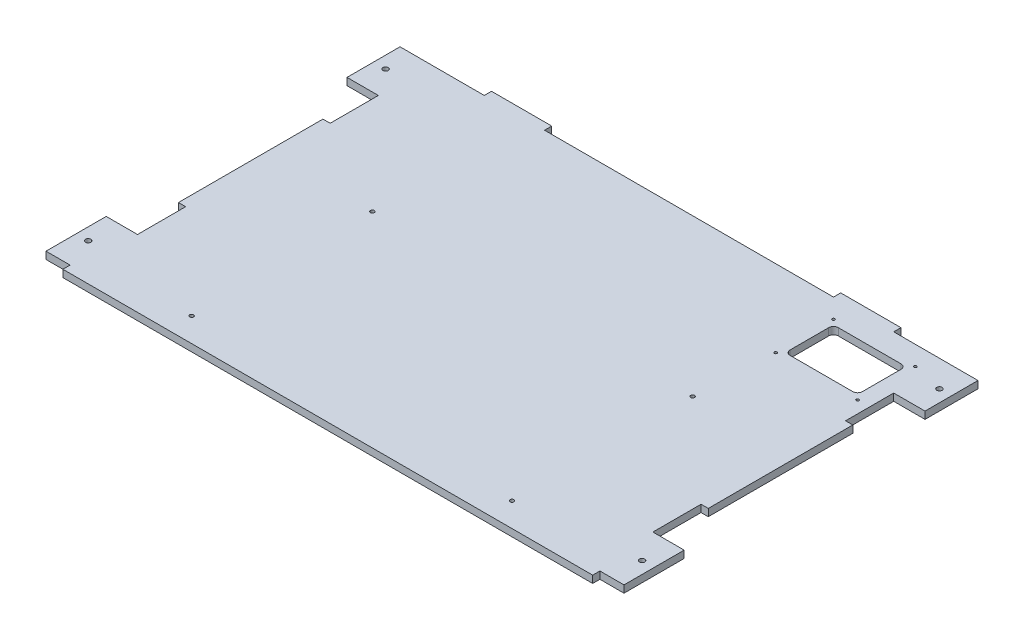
from build123d import *

# Parameters (mm, degrees)
SKIZZE1_R                       = 2.2
SKIZZE1_R_2                     = 1.1
SKIZZE1_R_3                     = 1.6
AUFSATZ_LINEAR_AUSTRAGEN1_DEPTH = 6


with BuildPart() as part:
    # Skizze1 → Aufsatz-Linear austragen1 (new body)
    with BuildSketch(Plane(origin=(0, 0, 0), x_dir=(1, 0, 0), z_dir=(0, 1, 0))):
        Polygon((-220, 150), (-170, 150), (-170, 156), (-120, 156), (-120, 150), (120, 150), (120, 156), (170, 156), (170, 150), (220, 150), (240, 150), (240, 106), (220, 106), (214, 106), (214, 66), (220, 66), (220, -54), (214, -54), (214, -94), (220, -94), (240, -94), (240, -144), (220, -144), (220, -150), (-220, -150), (-220, -144), (-240, -144), (-240, -94), (-220, -94), (-214, -94), (-214, -54), (-220, -54), (-220, 66), (-214, 66), (-214, 106), (-220, 106), (-240, 106), (-240, 150), align=None)
        with Locations(Location((-230, -119, 0), (0, 0, 270))):
            Circle(SKIZZE1_R, mode=Mode.SUBTRACT)
        with Locations(Location((-230, 128, 0), (0, 0, 270))):
            Circle(SKIZZE1_R, mode=Mode.SUBTRACT)
        with Locations(Location((230, -119, 0), (0, 0, 90))):
            Circle(SKIZZE1_R, mode=Mode.SUBTRACT)
        with Locations(Location((230, 128, 0), (0, 0, 90))):
            Circle(SKIZZE1_R, mode=Mode.SUBTRACT)
        with Locations(Location((136, 86, 0), (0, 0, 270))):
            Circle(SKIZZE1_R_2, mode=Mode.SUBTRACT)
        with Locations(Location((204, 86, 0), (0, 0, 90))):
            Circle(SKIZZE1_R_2, mode=Mode.SUBTRACT)
        with Locations(Location((136, 134, 0), (0, 0, 90))):
            Circle(SKIZZE1_R_2, mode=Mode.SUBTRACT)
        with Locations(Location((204, 134, 0), (0, 0, 270))):
            Circle(SKIZZE1_R_2, mode=Mode.SUBTRACT)
        with Locations(Location((-133, -130, 0), (0, 0, 270))):
            Circle(SKIZZE1_R_3, mode=Mode.SUBTRACT)
        with Locations(Location((-133, 20, 0), (0, 0, 270))):
            Circle(SKIZZE1_R_3, mode=Mode.SUBTRACT)
        with Locations(Location((133, 20, 0), (0, 0, 90))):
            Circle(SKIZZE1_R_3, mode=Mode.SUBTRACT)
        with Locations(Location((133, -130, 0), (0, 0, 90))):
            Circle(SKIZZE1_R_3, mode=Mode.SUBTRACT)
        with BuildLine():
            Line((144, 90), (196, 90))
            ThreePointArc((196, 90), (198.828427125, 91.171572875), (200, 94))
            Line((200, 94), (200, 126))
            ThreePointArc((200, 126), (198.828427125, 128.828427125), (196, 130))
            Line((196, 130), (144, 130))
            ThreePointArc((144, 130), (141.171572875, 128.828427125), (140, 126))
            Line((140, 126), (140, 94))
            ThreePointArc((140, 94), (141.171572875, 91.171572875), (144, 90))
        make_face(mode=Mode.SUBTRACT)
    extrude(amount=AUFSATZ_LINEAR_AUSTRAGEN1_DEPTH)


solid = part.part
